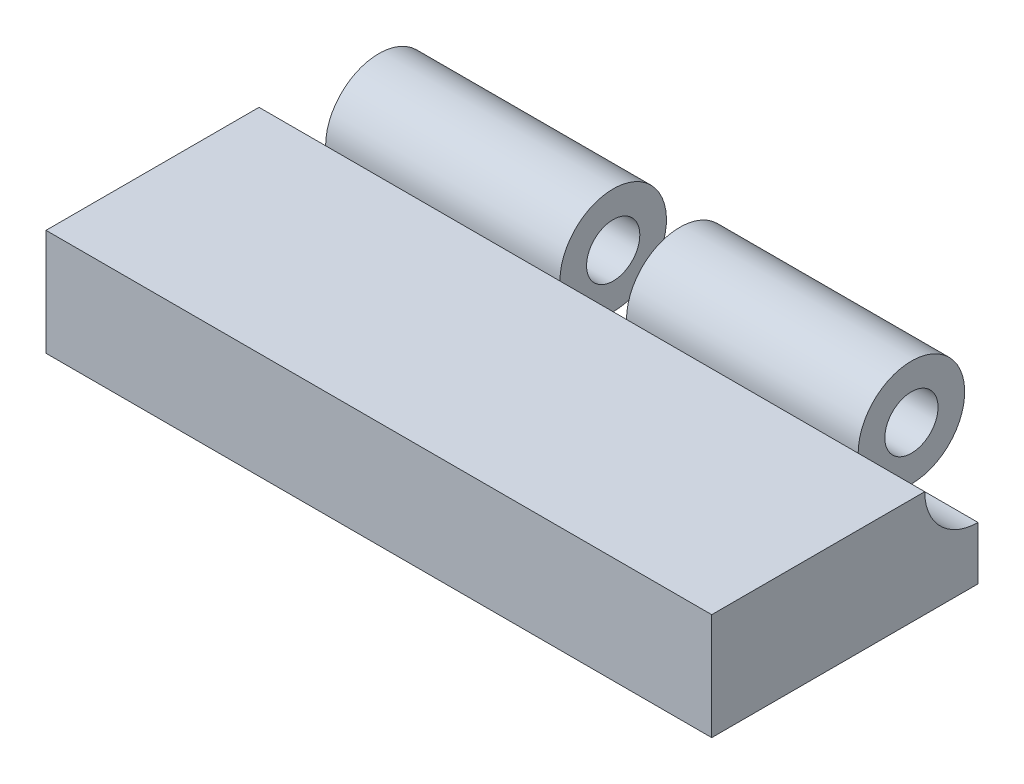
from build123d import *

# Parameters (mm, degrees)
SKETCH1_W                = 31.75
SKETCH1_H                = 12.7
BOSS_EXTRUDE1_DEPTH      = 5.08
BOSS_EXTRUDE2_DEPTH      = 12.6365
BOSS_EXTRUDE2_DEPTH_BACK = 12.7635
SKETCH2_R                = 2.54
SKETCH3_R                = 1.27
CUT_EXTRUDE2_DEPTH       = 37.033102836
SKETCH4_R                = 2.54
CUT_EXTRUDE3_DEPTH       = 3.175
CUT_EXTRUDE4_START       = -3.175
SKETCH5_R                = 2.54
CUT_EXTRUDE4_DEPTH       = 3.175
CUT_EXTRUDE5_DEPTH       = 1.5875
CUT_EXTRUDE5_DEPTH_BACK  = 1.5875
SKETCH6_R                = 2.54


with BuildPart() as part:
    # Sketch1 → Boss-Extrude1 (new body)
    with BuildSketch(Plane(origin=(0, 0, 0), x_dir=(1, 0, 0), z_dir=(0, 1, 0))):
        with Locations((15.875, 6.35)):
            Rectangle(SKETCH1_W, SKETCH1_H)
    extrude(amount=BOSS_EXTRUDE1_DEPTH)

    # Sketch2 → Boss-Extrude2 (add, two sides: drawn at the far end of the back side and taken through both)
    with BuildSketch(Plane(origin=(15.9385, 0, 0), x_dir=(0, 0, -1), z_dir=(1, 0, 0)).offset(-BOSS_EXTRUDE2_DEPTH_BACK)):
        with Locations((12.7, 5.08)):
            Circle(SKETCH2_R)
    extrude(amount=BOSS_EXTRUDE2_DEPTH + BOSS_EXTRUDE2_DEPTH_BACK)

    # Sketch3 → Cut-Extrude2 (cut, through all)
    with BuildSketch(Plane(origin=(0, 0, 0), x_dir=(0, 0, -1), z_dir=(1, 0, 0))):
        with Locations(Location((12.7, 5.08, 0), (0, 0, 180))):
            Circle(SKETCH3_R)
    extrude(amount=CUT_EXTRUDE2_DEPTH, mode=Mode.SUBTRACT)

    # Sketch4 → Cut-Extrude3 (cut)
    with BuildSketch(Plane(origin=(31.75, 0, 0), x_dir=(0, 0, -1), z_dir=(1, 0, 0))):
        with Locations((12.7, 5.08)):
            Circle(SKETCH4_R)
    extrude(amount=-CUT_EXTRUDE3_DEPTH, mode=Mode.SUBTRACT)

    # Sketch5 → Cut-Extrude4 (cut)
    with BuildSketch(Plane.ZY.offset(CUT_EXTRUDE4_START)):
        with Locations((-12.7, 5.08)):
            Circle(SKETCH5_R)
    extrude(amount=CUT_EXTRUDE4_DEPTH, mode=Mode.SUBTRACT)

    # Sketch6 → Cut-Extrude5 (cut, two sides: drawn at the far end of the back side and taken through both)
    with BuildSketch(Plane(origin=(15.9385, 0, 0), x_dir=(0, 0, -1), z_dir=(1, 0, 0)).offset(-CUT_EXTRUDE5_DEPTH_BACK)):
        with Locations((12.7, 5.08)):
            Circle(SKETCH6_R)
    extrude(amount=CUT_EXTRUDE5_DEPTH + CUT_EXTRUDE5_DEPTH_BACK, mode=Mode.SUBTRACT)


solid = part.part
